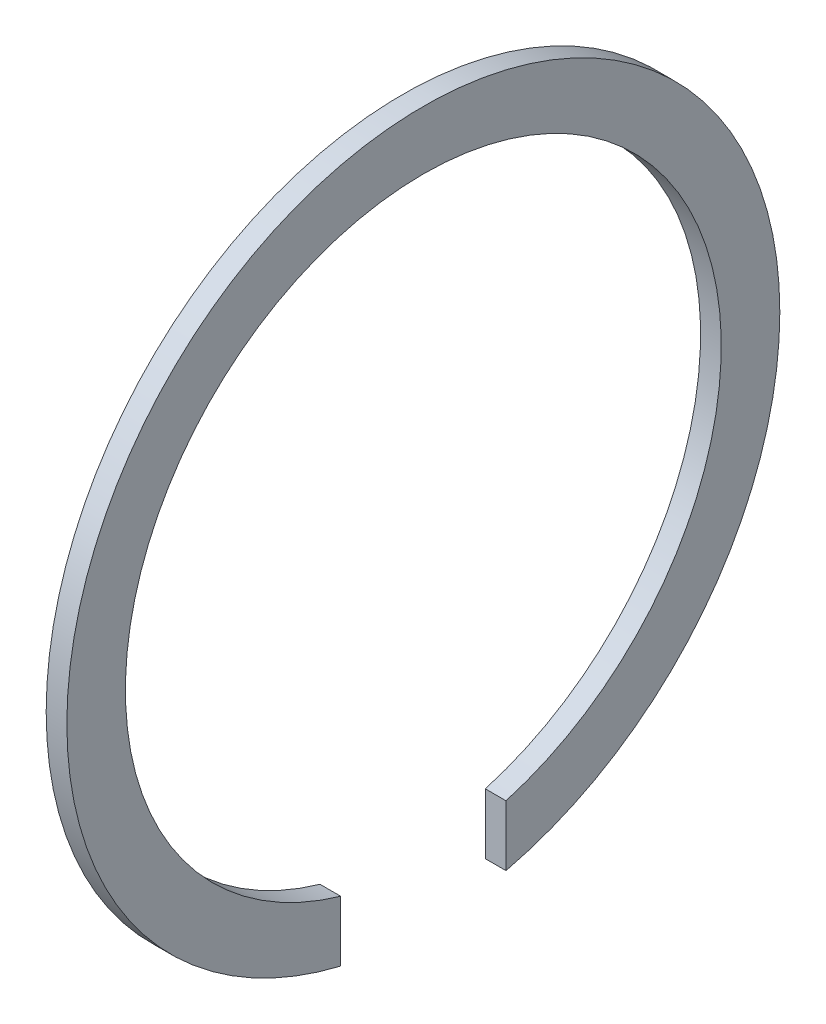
ISO-10303-21;
HEADER;
FILE_DESCRIPTION(('STEP AP214'),'2;1');
FILE_NAME('part.step','',(''),(''),'','','');
FILE_SCHEMA(('AUTOMOTIVE_DESIGN { 1 0 10303 214 1 1 1 1 }'));
ENDSEC;
DATA;
#1=APPLICATION_CONTEXT('core data for automotive mechanical design processes');
#2=APPLICATION_PROTOCOL_DEFINITION('international standard','automotive_design',2000,#1);
#3=PRODUCT_CONTEXT('',#1,'mechanical');
#4=PRODUCT('Part','Part','',(#3));
#5=PRODUCT_RELATED_PRODUCT_CATEGORY('part','',(#4));
#6=PRODUCT_DEFINITION_FORMATION('','',#4);
#7=PRODUCT_DEFINITION_CONTEXT('part definition',#1,'design');
#8=PRODUCT_DEFINITION('design','',#6,#7);
#9=PRODUCT_DEFINITION_SHAPE('','',#8);
#10=(LENGTH_UNIT() NAMED_UNIT(*) SI_UNIT(.MILLI.,.METRE.));
#11=(NAMED_UNIT(*) PLANE_ANGLE_UNIT() SI_UNIT($,.RADIAN.));
#12=(NAMED_UNIT(*) SI_UNIT($,.STERADIAN.) SOLID_ANGLE_UNIT());
#13=UNCERTAINTY_MEASURE_WITH_UNIT(LENGTH_MEASURE(1.E-05),#10,'distance_accuracy_value','');
#14=(GEOMETRIC_REPRESENTATION_CONTEXT(3) GLOBAL_UNCERTAINTY_ASSIGNED_CONTEXT((#13)) GLOBAL_UNIT_ASSIGNED_CONTEXT((#10,
#11,#12)) REPRESENTATION_CONTEXT('',''));
#15=CARTESIAN_POINT('',(0.,0.,0.));
#16=DIRECTION('',(0.,0.,1.));
#17=DIRECTION('',(1.,0.,0.));
#18=AXIS2_PLACEMENT_3D('',#15,#16,#17);
#19=CARTESIAN_POINT('',(-2.99999999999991,51.7499999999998,0.));
#20=DIRECTION('',(-0.999999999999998,0.,0.));
#21=DIRECTION('',(0.,0.,0.999999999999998));
#22=AXIS2_PLACEMENT_3D('',#19,#20,#21);
#23=PLANE('',#22);
#24=DIRECTION('',(0.,-0.999999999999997,0.));
#25=VECTOR('',#24,1.);
#26=CARTESIAN_POINT('',(-2.99999999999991,-0.31041335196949,12.));
#27=LINE('',#26,#25);
#28=CARTESIAN_POINT('',(-2.99999999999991,-41.5519253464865,12.));
#29=VERTEX_POINT('',#28);
#30=CARTESIAN_POINT('',(-2.99999999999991,-50.3394725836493,12.));
#31=VERTEX_POINT('',#30);
#32=EDGE_CURVE('E72',#29,#31,#27,.T.);
#33=ORIENTED_EDGE('',*,*,#32,.T.);
#34=CARTESIAN_POINT('',(-2.99999999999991,0.,0.));
#35=DIRECTION('',(0.999999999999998,0.,0.));
#36=DIRECTION('',(0.,0.,-0.999999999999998));
#37=AXIS2_PLACEMENT_3D('',#34,#35,#36);
#38=CIRCLE('',#37,51.75);
#39=CARTESIAN_POINT('',(-2.99999999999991,-50.3394725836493,-12.));
#40=VERTEX_POINT('',#39);
#41=EDGE_CURVE('E77',#40,#31,#38,.T.);
#42=ORIENTED_EDGE('',*,*,#41,.F.);
#43=DIRECTION('',(0.,0.999999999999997,0.));
#44=VECTOR('',#43,1.);
#45=CARTESIAN_POINT('',(-2.99999999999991,-0.31041335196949,-12.));
#46=LINE('',#45,#44);
#47=CARTESIAN_POINT('',(-2.99999999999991,-41.5519253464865,-12.));
#48=VERTEX_POINT('',#47);
#49=EDGE_CURVE('E53',#40,#48,#46,.T.);
#50=ORIENTED_EDGE('',*,*,#49,.T.);
#51=CARTESIAN_POINT('',(-2.99999999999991,0.,0.));
#52=DIRECTION('',(0.999999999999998,0.,0.));
#53=DIRECTION('',(0.,0.,-0.999999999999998));
#54=AXIS2_PLACEMENT_3D('',#51,#52,#53);
#55=CIRCLE('',#54,43.25);
#56=EDGE_CURVE('E92',#48,#29,#55,.T.);
#57=ORIENTED_EDGE('',*,*,#56,.T.);
#58=EDGE_LOOP('',(#33,#42,#50,#57));
#59=FACE_BOUND('',#58,.T.);
#60=ADVANCED_FACE('F32',(#59),#23,.T.);
#61=CARTESIAN_POINT('',(0.,0.,0.));
#62=DIRECTION('',(0.999999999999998,0.,0.));
#63=DIRECTION('',(0.,0.,-0.999999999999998));
#64=AXIS2_PLACEMENT_3D('',#61,#62,#63);
#65=CYLINDRICAL_SURFACE('',#64,43.25);
#66=DIRECTION('',(0.999999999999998,0.,0.));
#67=VECTOR('',#66,1.);
#68=CARTESIAN_POINT('',(0.,-41.5519253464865,12.));
#69=LINE('',#68,#67);
#70=CARTESIAN_POINT('',(0.,-41.5519253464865,12.));
#71=VERTEX_POINT('',#70);
#72=EDGE_CURVE('E69',#29,#71,#69,.T.);
#73=ORIENTED_EDGE('',*,*,#72,.F.);
#74=ORIENTED_EDGE('',*,*,#56,.F.);
#75=DIRECTION('',(0.999999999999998,0.,0.));
#76=VECTOR('',#75,1.);
#77=CARTESIAN_POINT('',(0.,-41.5519253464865,-12.));
#78=LINE('',#77,#76);
#79=CARTESIAN_POINT('',(0.,-41.5519253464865,-12.));
#80=VERTEX_POINT('',#79);
#81=EDGE_CURVE('E78',#80,#48,#78,.F.);
#82=ORIENTED_EDGE('',*,*,#81,.F.);
#83=CARTESIAN_POINT('',(0.,0.,0.));
#84=DIRECTION('',(0.999999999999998,0.,0.));
#85=DIRECTION('',(0.,0.,-0.999999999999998));
#86=AXIS2_PLACEMENT_3D('',#83,#84,#85);
#87=CIRCLE('',#86,43.25);
#88=EDGE_CURVE('E85',#80,#71,#87,.T.);
#89=ORIENTED_EDGE('',*,*,#88,.T.);
#90=EDGE_LOOP('',(#73,#74,#82,#89));
#91=FACE_BOUND('',#90,.T.);
#92=ADVANCED_FACE('F91',(#91),#65,.F.);
#93=CARTESIAN_POINT('',(0.,51.7499999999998,0.));
#94=DIRECTION('',(0.999999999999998,0.,0.));
#95=DIRECTION('',(0.,0.,-0.999999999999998));
#96=AXIS2_PLACEMENT_3D('',#93,#94,#95);
#97=PLANE('',#96);
#98=DIRECTION('',(0.,-0.999999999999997,0.));
#99=VECTOR('',#98,1.);
#100=CARTESIAN_POINT('',(0.,-0.31041335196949,12.));
#101=LINE('',#100,#99);
#102=CARTESIAN_POINT('',(0.,-50.3394725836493,12.));
#103=VERTEX_POINT('',#102);
#104=EDGE_CURVE('E45',#71,#103,#101,.T.);
#105=ORIENTED_EDGE('',*,*,#104,.F.);
#106=ORIENTED_EDGE('',*,*,#88,.F.);
#107=DIRECTION('',(0.,0.999999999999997,0.));
#108=VECTOR('',#107,1.);
#109=CARTESIAN_POINT('',(0.,-0.31041335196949,-12.));
#110=LINE('',#109,#108);
#111=CARTESIAN_POINT('',(0.,-50.3394725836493,-12.));
#112=VERTEX_POINT('',#111);
#113=EDGE_CURVE('E88',#112,#80,#110,.T.);
#114=ORIENTED_EDGE('',*,*,#113,.F.);
#115=CARTESIAN_POINT('',(0.,0.,0.));
#116=DIRECTION('',(0.999999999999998,0.,0.));
#117=DIRECTION('',(0.,0.,-0.999999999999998));
#118=AXIS2_PLACEMENT_3D('',#115,#116,#117);
#119=CIRCLE('',#118,51.75);
#120=EDGE_CURVE('E87',#112,#103,#119,.T.);
#121=ORIENTED_EDGE('',*,*,#120,.T.);
#122=EDGE_LOOP('',(#105,#106,#114,#121));
#123=FACE_BOUND('',#122,.T.);
#124=ADVANCED_FACE('F83',(#123),#97,.T.);
#125=CARTESIAN_POINT('',(0.,0.,0.));
#126=DIRECTION('',(0.999999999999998,0.,0.));
#127=DIRECTION('',(0.,0.,-0.999999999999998));
#128=AXIS2_PLACEMENT_3D('',#125,#126,#127);
#129=CYLINDRICAL_SURFACE('',#128,51.75);
#130=DIRECTION('',(0.999999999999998,0.,0.));
#131=VECTOR('',#130,1.);
#132=CARTESIAN_POINT('',(0.,-50.3394725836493,12.));
#133=LINE('',#132,#131);
#134=EDGE_CURVE('E11',#103,#31,#133,.F.);
#135=ORIENTED_EDGE('',*,*,#134,.F.);
#136=ORIENTED_EDGE('',*,*,#120,.F.);
#137=DIRECTION('',(0.999999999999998,0.,0.));
#138=VECTOR('',#137,1.);
#139=CARTESIAN_POINT('',(0.,-50.3394725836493,-12.));
#140=LINE('',#139,#138);
#141=EDGE_CURVE('E39',#40,#112,#140,.T.);
#142=ORIENTED_EDGE('',*,*,#141,.F.);
#143=ORIENTED_EDGE('',*,*,#41,.T.);
#144=EDGE_LOOP('',(#135,#136,#142,#143));
#145=FACE_BOUND('',#144,.T.);
#146=ADVANCED_FACE('F102',(#145),#129,.T.);
#147=CARTESIAN_POINT('',(-2.99999999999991,-0.31041335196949,-12.));
#148=DIRECTION('',(0.,0.,-0.999999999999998));
#149=DIRECTION('',(0.,0.999999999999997,0.));
#150=AXIS2_PLACEMENT_3D('',#147,#148,#149);
#151=PLANE('',#150);
#152=ORIENTED_EDGE('',*,*,#81,.T.);
#153=ORIENTED_EDGE('',*,*,#49,.F.);
#154=ORIENTED_EDGE('',*,*,#141,.T.);
#155=ORIENTED_EDGE('',*,*,#113,.T.);
#156=EDGE_LOOP('',(#152,#153,#154,#155));
#157=FACE_BOUND('',#156,.T.);
#158=ADVANCED_FACE('F97',(#157),#151,.F.);
#159=CARTESIAN_POINT('',(-2.99999999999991,-0.31041335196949,12.));
#160=DIRECTION('',(0.,0.,0.999999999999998));
#161=DIRECTION('',(0.,-0.999999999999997,0.));
#162=AXIS2_PLACEMENT_3D('',#159,#160,#161);
#163=PLANE('',#162);
#164=ORIENTED_EDGE('',*,*,#72,.T.);
#165=ORIENTED_EDGE('',*,*,#104,.T.);
#166=ORIENTED_EDGE('',*,*,#134,.T.);
#167=ORIENTED_EDGE('',*,*,#32,.F.);
#168=EDGE_LOOP('',(#164,#165,#166,#167));
#169=FACE_BOUND('',#168,.T.);
#170=ADVANCED_FACE('F70',(#169),#163,.F.);
#171=CLOSED_SHELL('',(#60,#92,#124,#146,#158,#170));
#172=MANIFOLD_SOLID_BREP('B2',#171);
#173=ADVANCED_BREP_SHAPE_REPRESENTATION('',(#18,#172),#14);
#174=SHAPE_DEFINITION_REPRESENTATION(#9,#173);
ENDSEC;
END-ISO-10303-21;
